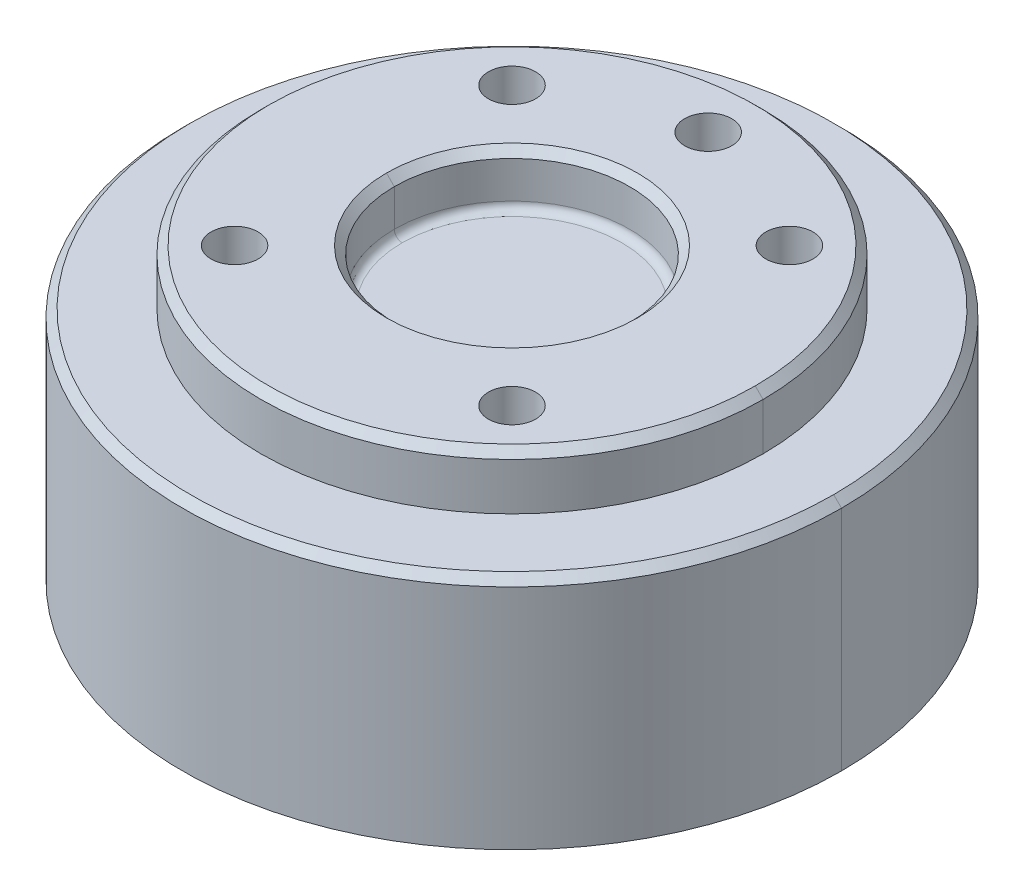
ISO-10303-21;
HEADER;
FILE_DESCRIPTION(('STEP AP214'),'2;1');
FILE_NAME('part.step','',(''),(''),'','','');
FILE_SCHEMA(('AUTOMOTIVE_DESIGN { 1 0 10303 214 1 1 1 1 }'));
ENDSEC;
DATA;
#1=APPLICATION_CONTEXT('core data for automotive mechanical design processes');
#2=APPLICATION_PROTOCOL_DEFINITION('international standard','automotive_design',2000,#1);
#3=PRODUCT_CONTEXT('',#1,'mechanical');
#4=PRODUCT('Part','Part','',(#3));
#5=PRODUCT_RELATED_PRODUCT_CATEGORY('part','',(#4));
#6=PRODUCT_DEFINITION_FORMATION('','',#4);
#7=PRODUCT_DEFINITION_CONTEXT('part definition',#1,'design');
#8=PRODUCT_DEFINITION('design','',#6,#7);
#9=PRODUCT_DEFINITION_SHAPE('','',#8);
#10=(LENGTH_UNIT() NAMED_UNIT(*) SI_UNIT(.MILLI.,.METRE.));
#11=(NAMED_UNIT(*) PLANE_ANGLE_UNIT() SI_UNIT($,.RADIAN.));
#12=(NAMED_UNIT(*) SI_UNIT($,.STERADIAN.) SOLID_ANGLE_UNIT());
#13=UNCERTAINTY_MEASURE_WITH_UNIT(LENGTH_MEASURE(1.E-05),#10,'distance_accuracy_value','');
#14=(GEOMETRIC_REPRESENTATION_CONTEXT(3) GLOBAL_UNCERTAINTY_ASSIGNED_CONTEXT((#13)) GLOBAL_UNIT_ASSIGNED_CONTEXT((#10,
#11,#12)) REPRESENTATION_CONTEXT('',''));
#15=CARTESIAN_POINT('',(0.,0.,0.));
#16=DIRECTION('',(0.,0.,1.));
#17=DIRECTION('',(1.,0.,0.));
#18=AXIS2_PLACEMENT_3D('',#15,#16,#17);
#19=CARTESIAN_POINT('',(0.,29.,0.));
#20=DIRECTION('',(0.,1.,0.));
#21=DIRECTION('',(-1.,0.,0.));
#22=AXIS2_PLACEMENT_3D('',#19,#20,#21);
#23=PLANE('',#22);
#24=CARTESIAN_POINT('',(0.,29.,-25.));
#25=DIRECTION('',(0.,1.,0.));
#26=DIRECTION('',(0.,0.,1.));
#27=AXIS2_PLACEMENT_3D('',#24,#25,#26);
#28=CIRCLE('',#27,3.);
#29=CARTESIAN_POINT('',(0.,29.,-22.));
#30=VERTEX_POINT('',#29);
#31=EDGE_CURVE('E28',#30,#30,#28,.T.);
#32=ORIENTED_EDGE('',*,*,#31,.T.);
#33=EDGE_LOOP('',(#32));
#34=FACE_BOUND('',#33,.T.);
#35=ADVANCED_FACE('F16',(#34),#23,.T.);
#36=CARTESIAN_POINT('',(0.,24.,0.));
#37=DIRECTION('',(0.,1.,0.));
#38=DIRECTION('',(0.,0.,1.));
#39=AXIS2_PLACEMENT_3D('',#36,#37,#38);
#40=PLANE('',#39);
#41=CARTESIAN_POINT('',(17.677669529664,24.,17.6776695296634));
#42=DIRECTION('',(0.,1.,0.));
#43=DIRECTION('',(0.,0.,1.));
#44=AXIS2_PLACEMENT_3D('',#41,#42,#43);
#45=CIRCLE('',#44,3.);
#46=CARTESIAN_POINT('',(17.677669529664,24.,20.6776695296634));
#47=VERTEX_POINT('',#46);
#48=EDGE_CURVE('E33',#47,#47,#45,.T.);
#49=ORIENTED_EDGE('',*,*,#48,.T.);
#50=EDGE_LOOP('',(#49));
#51=FACE_BOUND('',#50,.T.);
#52=ADVANCED_FACE('F408',(#51),#40,.T.);
#53=CARTESIAN_POINT('',(0.,24.,0.));
#54=DIRECTION('',(0.,1.,0.));
#55=DIRECTION('',(0.,0.,1.));
#56=AXIS2_PLACEMENT_3D('',#53,#54,#55);
#57=PLANE('',#56);
#58=CARTESIAN_POINT('',(-17.6776695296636,24.,17.6776695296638));
#59=DIRECTION('',(0.,1.,0.));
#60=DIRECTION('',(0.,0.,1.));
#61=AXIS2_PLACEMENT_3D('',#58,#59,#60);
#62=CIRCLE('',#61,3.);
#63=CARTESIAN_POINT('',(-17.6776695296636,24.,20.6776695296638));
#64=VERTEX_POINT('',#63);
#65=EDGE_CURVE('E316',#64,#64,#62,.T.);
#66=ORIENTED_EDGE('',*,*,#65,.T.);
#67=EDGE_LOOP('',(#66));
#68=FACE_BOUND('',#67,.T.);
#69=ADVANCED_FACE('F406',(#68),#57,.T.);
#70=CARTESIAN_POINT('',(0.,24.,0.));
#71=DIRECTION('',(0.,1.,0.));
#72=DIRECTION('',(0.,0.,1.));
#73=AXIS2_PLACEMENT_3D('',#70,#71,#72);
#74=PLANE('',#73);
#75=CARTESIAN_POINT('',(-17.6776695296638,24.,-17.6776695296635));
#76=DIRECTION('',(0.,1.,0.));
#77=DIRECTION('',(0.,0.,1.));
#78=AXIS2_PLACEMENT_3D('',#75,#76,#77);
#79=CIRCLE('',#78,3.);
#80=CARTESIAN_POINT('',(-17.6776695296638,24.,-14.6776695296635));
#81=VERTEX_POINT('',#80);
#82=EDGE_CURVE('E156',#81,#81,#79,.T.);
#83=ORIENTED_EDGE('',*,*,#82,.T.);
#84=EDGE_LOOP('',(#83));
#85=FACE_BOUND('',#84,.T.);
#86=ADVANCED_FACE('F322',(#85),#74,.T.);
#87=CARTESIAN_POINT('',(0.,24.,0.));
#88=DIRECTION('',(0.,1.,0.));
#89=DIRECTION('',(-1.,0.,0.));
#90=AXIS2_PLACEMENT_3D('',#87,#88,#89);
#91=PLANE('',#90);
#92=CARTESIAN_POINT('',(17.6776695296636,24.,-17.6776695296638));
#93=DIRECTION('',(0.,1.,0.));
#94=DIRECTION('',(0.,0.,1.));
#95=AXIS2_PLACEMENT_3D('',#92,#93,#94);
#96=CIRCLE('',#95,3.);
#97=CARTESIAN_POINT('',(17.6776695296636,24.,-14.6776695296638));
#98=VERTEX_POINT('',#97);
#99=EDGE_CURVE('E153',#98,#98,#96,.T.);
#100=ORIENTED_EDGE('',*,*,#99,.T.);
#101=EDGE_LOOP('',(#100));
#102=FACE_BOUND('',#101,.T.);
#103=ADVANCED_FACE('F399',(#102),#91,.T.);
#104=CARTESIAN_POINT('',(0.,37.,-25.));
#105=DIRECTION('',(0.,1.,0.));
#106=DIRECTION('',(0.,0.,1.));
#107=AXIS2_PLACEMENT_3D('',#104,#105,#106);
#108=CYLINDRICAL_SURFACE('',#107,3.);
#109=ORIENTED_EDGE('',*,*,#31,.F.);
#110=EDGE_LOOP('',(#109));
#111=FACE_BOUND('',#110,.T.);
#112=CARTESIAN_POINT('',(0.,37.,-25.));
#113=DIRECTION('',(0.,1.,0.));
#114=DIRECTION('',(0.,0.,1.));
#115=AXIS2_PLACEMENT_3D('',#112,#113,#114);
#116=CIRCLE('',#115,3.);
#117=CARTESIAN_POINT('',(0.,37.,-22.));
#118=VERTEX_POINT('',#117);
#119=EDGE_CURVE('E344',#118,#118,#116,.T.);
#120=ORIENTED_EDGE('',*,*,#119,.T.);
#121=EDGE_LOOP('',(#120));
#122=FACE_BOUND('',#121,.T.);
#123=ADVANCED_FACE('F402',(#111,#122),#108,.F.);
#124=CARTESIAN_POINT('',(0.,37.,0.));
#125=DIRECTION('',(0.,1.,0.));
#126=DIRECTION('',(0.,0.,1.));
#127=AXIS2_PLACEMENT_3D('',#124,#125,#126);
#128=PLANE('',#127);
#129=ORIENTED_EDGE('',*,*,#119,.F.);
#130=EDGE_LOOP('',(#129));
#131=FACE_BOUND('',#130,.T.);
#132=CARTESIAN_POINT('',(17.677669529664,37.,17.6776695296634));
#133=DIRECTION('',(0.,1.,0.));
#134=DIRECTION('',(0.,0.,1.));
#135=AXIS2_PLACEMENT_3D('',#132,#133,#134);
#136=CIRCLE('',#135,3.);
#137=CARTESIAN_POINT('',(17.677669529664,37.,20.6776695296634));
#138=VERTEX_POINT('',#137);
#139=EDGE_CURVE('E339',#138,#138,#136,.T.);
#140=ORIENTED_EDGE('',*,*,#139,.F.);
#141=EDGE_LOOP('',(#140));
#142=FACE_BOUND('',#141,.T.);
#143=CARTESIAN_POINT('',(-17.6776695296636,37.,17.6776695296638));
#144=DIRECTION('',(0.,1.,0.));
#145=DIRECTION('',(0.,0.,1.));
#146=AXIS2_PLACEMENT_3D('',#143,#144,#145);
#147=CIRCLE('',#146,3.);
#148=CARTESIAN_POINT('',(-17.6776695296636,37.,20.6776695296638));
#149=VERTEX_POINT('',#148);
#150=EDGE_CURVE('E334',#149,#149,#147,.T.);
#151=ORIENTED_EDGE('',*,*,#150,.F.);
#152=EDGE_LOOP('',(#151));
#153=FACE_BOUND('',#152,.T.);
#154=CARTESIAN_POINT('',(-17.6776695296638,37.,-17.6776695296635));
#155=DIRECTION('',(0.,1.,0.));
#156=DIRECTION('',(0.,0.,1.));
#157=AXIS2_PLACEMENT_3D('',#154,#155,#156);
#158=CIRCLE('',#157,3.);
#159=CARTESIAN_POINT('',(-17.6776695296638,37.,-14.6776695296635));
#160=VERTEX_POINT('',#159);
#161=EDGE_CURVE('E332',#160,#160,#158,.T.);
#162=ORIENTED_EDGE('',*,*,#161,.F.);
#163=EDGE_LOOP('',(#162));
#164=FACE_BOUND('',#163,.T.);
#165=CARTESIAN_POINT('',(17.6776695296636,37.,-17.6776695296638));
#166=DIRECTION('',(0.,1.,0.));
#167=DIRECTION('',(0.,0.,1.));
#168=AXIS2_PLACEMENT_3D('',#165,#166,#167);
#169=CIRCLE('',#168,3.);
#170=CARTESIAN_POINT('',(17.6776695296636,37.,-14.6776695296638));
#171=VERTEX_POINT('',#170);
#172=EDGE_CURVE('E139',#171,#171,#169,.T.);
#173=ORIENTED_EDGE('',*,*,#172,.F.);
#174=EDGE_LOOP('',(#173));
#175=FACE_BOUND('',#174,.T.);
#176=CARTESIAN_POINT('',(0.,37.0000000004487,0.));
#177=DIRECTION('',(0.,-1.,0.));
#178=DIRECTION('',(0.,0.,-1.));
#179=AXIS2_PLACEMENT_3D('',#176,#177,#178);
#180=CIRCLE('',#179,30.9999999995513);
#181=CARTESIAN_POINT('',(-30.9999999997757,37.0000000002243,9.22828831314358E-08));
#182=VERTEX_POINT('',#181);
#183=CARTESIAN_POINT('',(30.9999999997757,37.0000000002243,7.30811161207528E-08));
#184=VERTEX_POINT('',#183);
#185=EDGE_CURVE('E131',#182,#184,#180,.T.);
#186=ORIENTED_EDGE('',*,*,#185,.F.);
#187=CARTESIAN_POINT('',(0.,37.,-1.21484962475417E-13));
#188=DIRECTION('',(0.,-1.,0.));
#189=DIRECTION('',(0.,0.,-1.));
#190=AXIS2_PLACEMENT_3D('',#187,#188,#189);
#191=CIRCLE('',#190,31.);
#192=EDGE_CURVE('E135',#184,#182,#191,.T.);
#193=ORIENTED_EDGE('',*,*,#192,.F.);
#194=EDGE_LOOP('',(#186,#193));
#195=FACE_BOUND('',#194,.T.);
#196=CARTESIAN_POINT('',(0.,37.,0.));
#197=DIRECTION('',(0.,1.,0.));
#198=DIRECTION('',(0.,0.,1.));
#199=AXIS2_PLACEMENT_3D('',#196,#197,#198);
#200=CIRCLE('',#199,16.);
#201=CARTESIAN_POINT('',(-16.,37.,-3.20409330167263E-07));
#202=VERTEX_POINT('',#201);
#203=CARTESIAN_POINT('',(16.,37.,-3.5926469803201E-07));
#204=VERTEX_POINT('',#203);
#205=EDGE_CURVE('E147',#202,#204,#200,.F.);
#206=ORIENTED_EDGE('',*,*,#205,.T.);
#207=CARTESIAN_POINT('',(0.,37.,0.));
#208=DIRECTION('',(0.,1.,0.));
#209=DIRECTION('',(0.,0.,1.));
#210=AXIS2_PLACEMENT_3D('',#207,#208,#209);
#211=CIRCLE('',#210,16.);
#212=EDGE_CURVE('E314',#204,#202,#211,.F.);
#213=ORIENTED_EDGE('',*,*,#212,.T.);
#214=EDGE_LOOP('',(#206,#213));
#215=FACE_BOUND('',#214,.T.);
#216=ADVANCED_FACE('F133',(#131,#142,#153,#164,#175,#195,#215),#128,.T.);
#217=CARTESIAN_POINT('',(17.677669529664,37.,17.6776695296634));
#218=DIRECTION('',(0.,1.,0.));
#219=DIRECTION('',(0.,0.,1.));
#220=AXIS2_PLACEMENT_3D('',#217,#218,#219);
#221=CYLINDRICAL_SURFACE('',#220,3.);
#222=ORIENTED_EDGE('',*,*,#48,.F.);
#223=EDGE_LOOP('',(#222));
#224=FACE_BOUND('',#223,.T.);
#225=ORIENTED_EDGE('',*,*,#139,.T.);
#226=EDGE_LOOP('',(#225));
#227=FACE_BOUND('',#226,.T.);
#228=ADVANCED_FACE('F441',(#224,#227),#221,.F.);
#229=CARTESIAN_POINT('',(-17.6776695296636,37.,17.6776695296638));
#230=DIRECTION('',(0.,1.,0.));
#231=DIRECTION('',(0.,0.,1.));
#232=AXIS2_PLACEMENT_3D('',#229,#230,#231);
#233=CYLINDRICAL_SURFACE('',#232,3.);
#234=ORIENTED_EDGE('',*,*,#65,.F.);
#235=EDGE_LOOP('',(#234));
#236=FACE_BOUND('',#235,.T.);
#237=ORIENTED_EDGE('',*,*,#150,.T.);
#238=EDGE_LOOP('',(#237));
#239=FACE_BOUND('',#238,.T.);
#240=ADVANCED_FACE('F328',(#236,#239),#233,.F.);
#241=CARTESIAN_POINT('',(-17.6776695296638,37.,-17.6776695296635));
#242=DIRECTION('',(0.,1.,0.));
#243=DIRECTION('',(0.,0.,1.));
#244=AXIS2_PLACEMENT_3D('',#241,#242,#243);
#245=CYLINDRICAL_SURFACE('',#244,3.);
#246=ORIENTED_EDGE('',*,*,#82,.F.);
#247=EDGE_LOOP('',(#246));
#248=FACE_BOUND('',#247,.T.);
#249=ORIENTED_EDGE('',*,*,#161,.T.);
#250=EDGE_LOOP('',(#249));
#251=FACE_BOUND('',#250,.T.);
#252=ADVANCED_FACE('F324',(#248,#251),#245,.F.);
#253=CARTESIAN_POINT('',(17.6776695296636,37.,-17.6776695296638));
#254=DIRECTION('',(0.,1.,0.));
#255=DIRECTION('',(0.,0.,1.));
#256=AXIS2_PLACEMENT_3D('',#253,#254,#255);
#257=CYLINDRICAL_SURFACE('',#256,3.);
#258=ORIENTED_EDGE('',*,*,#99,.F.);
#259=EDGE_LOOP('',(#258));
#260=FACE_BOUND('',#259,.T.);
#261=ORIENTED_EDGE('',*,*,#172,.T.);
#262=EDGE_LOOP('',(#261));
#263=FACE_BOUND('',#262,.T.);
#264=ADVANCED_FACE('F327',(#260,#263),#257,.F.);
#265=CARTESIAN_POINT('',(0.,37.1097664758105,0.));
#266=DIRECTION('',(0.,-1.,0.));
#267=DIRECTION('',(0.,0.,-1.));
#268=AXIS2_PLACEMENT_3D('',#265,#266,#267);
#269=CONICAL_SURFACE('',#268,30.8902335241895,0.785398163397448);
#270=DIRECTION('',(-0.707106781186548,-0.707106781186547,2.10496593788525E-09));
#271=VECTOR('',#270,1.);
#272=CARTESIAN_POINT('',(-30.8902335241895,37.1097664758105,9.19561305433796E-08));
#273=LINE('',#272,#271);
#274=CARTESIAN_POINT('',(-31.9999999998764,36.0000000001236,7.14448153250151E-08));
#275=VERTEX_POINT('',#274);
#276=EDGE_CURVE('E144',#182,#275,#273,.T.);
#277=ORIENTED_EDGE('',*,*,#276,.F.);
#278=ORIENTED_EDGE('',*,*,#185,.T.);
#279=DIRECTION('',(0.707106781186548,-0.707106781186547,1.66697544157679E-09));
#280=VECTOR('',#279,1.);
#281=CARTESIAN_POINT('',(30.8902335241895,37.1097664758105,7.28223461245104E-08));
#282=LINE('',#281,#280);
#283=CARTESIAN_POINT('',(31.9999999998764,36.0000000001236,5.65789320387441E-08));
#284=VERTEX_POINT('',#283);
#285=EDGE_CURVE('E146',#284,#184,#282,.F.);
#286=ORIENTED_EDGE('',*,*,#285,.F.);
#287=CARTESIAN_POINT('',(0.,36.,0.));
#288=DIRECTION('',(0.,-1.,0.));
#289=DIRECTION('',(0.,0.,-1.));
#290=AXIS2_PLACEMENT_3D('',#287,#288,#289);
#291=CIRCLE('',#290,32.);
#292=EDGE_CURVE('E151',#284,#275,#291,.F.);
#293=ORIENTED_EDGE('',*,*,#292,.T.);
#294=EDGE_LOOP('',(#277,#278,#286,#293));
#295=FACE_BOUND('',#294,.T.);
#296=ADVANCED_FACE('F149',(#295),#269,.T.);
#297=CARTESIAN_POINT('',(0.,37.1097664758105,-1.21484962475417E-13));
#298=DIRECTION('',(0.,-1.,0.));
#299=DIRECTION('',(0.,0.,-1.));
#300=AXIS2_PLACEMENT_3D('',#297,#298,#299);
#301=CONICAL_SURFACE('',#300,30.8902335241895,0.785398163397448);
#302=ORIENTED_EDGE('',*,*,#285,.T.);
#303=ORIENTED_EDGE('',*,*,#192,.T.);
#304=ORIENTED_EDGE('',*,*,#276,.T.);
#305=CARTESIAN_POINT('',(0.,36.0000000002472,-1.21484962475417E-13));
#306=DIRECTION('',(0.,-1.,0.));
#307=DIRECTION('',(0.,0.,-1.));
#308=AXIS2_PLACEMENT_3D('',#305,#306,#307);
#309=CIRCLE('',#308,31.9999999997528);
#310=EDGE_CURVE('E161',#275,#284,#309,.F.);
#311=ORIENTED_EDGE('',*,*,#310,.T.);
#312=EDGE_LOOP('',(#302,#303,#304,#311));
#313=FACE_BOUND('',#312,.T.);
#314=ADVANCED_FACE('F142',(#313),#301,.T.);
#315=CARTESIAN_POINT('',(0.,30.,0.));
#316=DIRECTION('',(0.,1.,0.));
#317=DIRECTION('',(0.,0.,1.));
#318=AXIS2_PLACEMENT_3D('',#315,#316,#317);
#319=CYLINDRICAL_SURFACE('',#318,32.);
#320=DIRECTION('',(0.,1.,0.));
#321=VECTOR('',#320,1.);
#322=CARTESIAN_POINT('',(32.,30.,0.));
#323=LINE('',#322,#321);
#324=CARTESIAN_POINT('',(32.,30.,0.));
#325=VERTEX_POINT('',#324);
#326=EDGE_CURVE('E163',#284,#325,#323,.F.);
#327=ORIENTED_EDGE('',*,*,#326,.F.);
#328=ORIENTED_EDGE('',*,*,#310,.F.);
#329=DIRECTION('',(0.,1.,0.));
#330=VECTOR('',#329,1.);
#331=CARTESIAN_POINT('',(-32.,30.,0.));
#332=LINE('',#331,#330);
#333=CARTESIAN_POINT('',(-32.,30.,0.));
#334=VERTEX_POINT('',#333);
#335=EDGE_CURVE('E165',#334,#275,#332,.T.);
#336=ORIENTED_EDGE('',*,*,#335,.F.);
#337=CARTESIAN_POINT('',(0.,30.,0.));
#338=DIRECTION('',(0.,1.,0.));
#339=DIRECTION('',(0.,0.,1.));
#340=AXIS2_PLACEMENT_3D('',#337,#338,#339);
#341=CIRCLE('',#340,32.);
#342=EDGE_CURVE('E168',#325,#334,#341,.F.);
#343=ORIENTED_EDGE('',*,*,#342,.F.);
#344=EDGE_LOOP('',(#327,#328,#336,#343));
#345=FACE_BOUND('',#344,.T.);
#346=ADVANCED_FACE('F635',(#345),#319,.T.);
#347=CARTESIAN_POINT('',(0.,30.,0.));
#348=DIRECTION('',(0.,1.,0.));
#349=DIRECTION('',(0.,0.,1.));
#350=AXIS2_PLACEMENT_3D('',#347,#348,#349);
#351=CYLINDRICAL_SURFACE('',#350,32.);
#352=ORIENTED_EDGE('',*,*,#335,.T.);
#353=ORIENTED_EDGE('',*,*,#292,.F.);
#354=ORIENTED_EDGE('',*,*,#326,.T.);
#355=CARTESIAN_POINT('',(0.,30.,0.));
#356=DIRECTION('',(0.,1.,0.));
#357=DIRECTION('',(0.,0.,1.));
#358=AXIS2_PLACEMENT_3D('',#355,#356,#357);
#359=CIRCLE('',#358,32.);
#360=EDGE_CURVE('E171',#334,#325,#359,.F.);
#361=ORIENTED_EDGE('',*,*,#360,.F.);
#362=EDGE_LOOP('',(#352,#353,#354,#361));
#363=FACE_BOUND('',#362,.T.);
#364=ADVANCED_FACE('F627',(#363),#351,.T.);
#365=CARTESIAN_POINT('',(0.,30.,0.));
#366=DIRECTION('',(0.,1.,0.));
#367=DIRECTION('',(0.,0.,1.));
#368=AXIS2_PLACEMENT_3D('',#365,#366,#367);
#369=PLANE('',#368);
#370=CARTESIAN_POINT('',(0.,30.0000000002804,0.));
#371=DIRECTION('',(0.,-1.,0.));
#372=DIRECTION('',(0.,0.,-1.));
#373=AXIS2_PLACEMENT_3D('',#370,#371,#372);
#374=CIRCLE('',#373,40.9999999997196);
#375=CARTESIAN_POINT('',(-40.9999999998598,30.0000000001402,7.80053308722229E-08));
#376=VERTEX_POINT('',#375);
#377=CARTESIAN_POINT('',(40.9999999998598,30.0000000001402,6.02068889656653E-08));
#378=VERTEX_POINT('',#377);
#379=EDGE_CURVE('E174',#376,#378,#374,.T.);
#380=ORIENTED_EDGE('',*,*,#379,.F.);
#381=CARTESIAN_POINT('',(0.,30.,-2.10884178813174E-13));
#382=DIRECTION('',(0.,-1.,0.));
#383=DIRECTION('',(0.,0.,-1.));
#384=AXIS2_PLACEMENT_3D('',#381,#382,#383);
#385=CIRCLE('',#384,41.);
#386=EDGE_CURVE('E176',#378,#376,#385,.T.);
#387=ORIENTED_EDGE('',*,*,#386,.F.);
#388=EDGE_LOOP('',(#380,#387));
#389=FACE_BOUND('',#388,.T.);
#390=ORIENTED_EDGE('',*,*,#342,.T.);
#391=ORIENTED_EDGE('',*,*,#360,.T.);
#392=EDGE_LOOP('',(#390,#391));
#393=FACE_BOUND('',#392,.T.);
#394=ADVANCED_FACE('F619',(#389,#393),#369,.T.);
#395=CARTESIAN_POINT('',(0.,30.1097664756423,0.));
#396=DIRECTION('',(0.,-1.,0.));
#397=DIRECTION('',(0.,0.,-1.));
#398=AXIS2_PLACEMENT_3D('',#395,#396,#397);
#399=CONICAL_SURFACE('',#398,40.8902335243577,0.785398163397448);
#400=DIRECTION('',(-0.707106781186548,-0.707106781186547,1.34532317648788E-09));
#401=VECTOR('',#400,1.);
#402=CARTESIAN_POINT('',(-40.8902335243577,30.1097664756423,7.7796495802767E-08));
#403=LINE('',#402,#401);
#404=CARTESIAN_POINT('',(-41.9999999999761,29.0000000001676,2.99654610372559E-08));
#405=VERTEX_POINT('',#404);
#406=EDGE_CURVE('E179',#376,#405,#403,.T.);
#407=ORIENTED_EDGE('',*,*,#406,.F.);
#408=ORIENTED_EDGE('',*,*,#379,.T.);
#409=DIRECTION('',(0.707106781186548,-0.707106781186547,1.03836223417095E-09));
#410=VECTOR('',#409,1.);
#411=CARTESIAN_POINT('',(40.8902335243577,30.1097664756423,6.00457049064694E-08));
#412=LINE('',#411,#410);
#413=CARTESIAN_POINT('',(41.9999999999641,29.0000000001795,1.54188417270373E-08));
#414=VERTEX_POINT('',#413);
#415=EDGE_CURVE('E181',#414,#378,#412,.F.);
#416=ORIENTED_EDGE('',*,*,#415,.F.);
#417=CARTESIAN_POINT('',(0.,29.,0.));
#418=DIRECTION('',(0.,1.,0.));
#419=DIRECTION('',(0.,0.,1.));
#420=AXIS2_PLACEMENT_3D('',#417,#418,#419);
#421=CIRCLE('',#420,42.);
#422=EDGE_CURVE('E184',#405,#414,#421,.F.);
#423=ORIENTED_EDGE('',*,*,#422,.F.);
#424=EDGE_LOOP('',(#407,#408,#416,#423));
#425=FACE_BOUND('',#424,.T.);
#426=ADVANCED_FACE('F611',(#425),#399,.T.);
#427=CARTESIAN_POINT('',(0.,30.1097664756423,-2.10884178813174E-13));
#428=DIRECTION('',(0.,-1.,0.));
#429=DIRECTION('',(0.,0.,-1.));
#430=AXIS2_PLACEMENT_3D('',#427,#428,#429);
#431=CONICAL_SURFACE('',#430,40.8902335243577,0.785398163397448);
#432=ORIENTED_EDGE('',*,*,#415,.T.);
#433=ORIENTED_EDGE('',*,*,#386,.T.);
#434=ORIENTED_EDGE('',*,*,#406,.T.);
#435=CARTESIAN_POINT('',(0.,29.0000000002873,0.));
#436=DIRECTION('',(0.,1.,0.));
#437=DIRECTION('',(0.,0.,1.));
#438=AXIS2_PLACEMENT_3D('',#435,#436,#437);
#439=CIRCLE('',#438,42.);
#440=EDGE_CURVE('E187',#414,#405,#439,.F.);
#441=ORIENTED_EDGE('',*,*,#440,.F.);
#442=EDGE_LOOP('',(#432,#433,#434,#441));
#443=FACE_BOUND('',#442,.T.);
#444=ADVANCED_FACE('F603',(#443),#431,.T.);
#445=CARTESIAN_POINT('',(0.,0.,0.));
#446=DIRECTION('',(0.,1.,0.));
#447=DIRECTION('',(0.,0.,1.));
#448=AXIS2_PLACEMENT_3D('',#445,#446,#447);
#449=CYLINDRICAL_SURFACE('',#448,42.);
#450=DIRECTION('',(0.,1.,0.));
#451=VECTOR('',#450,1.);
#452=CARTESIAN_POINT('',(42.,0.,0.));
#453=LINE('',#452,#451);
#454=CARTESIAN_POINT('',(42.,0.,0.));
#455=VERTEX_POINT('',#454);
#456=EDGE_CURVE('E190',#455,#414,#453,.T.);
#457=ORIENTED_EDGE('',*,*,#456,.T.);
#458=ORIENTED_EDGE('',*,*,#440,.T.);
#459=DIRECTION('',(0.,1.,0.));
#460=VECTOR('',#459,1.);
#461=CARTESIAN_POINT('',(-42.,0.,0.));
#462=LINE('',#461,#460);
#463=CARTESIAN_POINT('',(-42.,0.,0.));
#464=VERTEX_POINT('',#463);
#465=EDGE_CURVE('E193',#405,#464,#462,.F.);
#466=ORIENTED_EDGE('',*,*,#465,.T.);
#467=CARTESIAN_POINT('',(0.,0.,0.));
#468=DIRECTION('',(0.,1.,0.));
#469=DIRECTION('',(0.,0.,1.));
#470=AXIS2_PLACEMENT_3D('',#467,#468,#469);
#471=CIRCLE('',#470,42.);
#472=EDGE_CURVE('E195',#464,#455,#471,.T.);
#473=ORIENTED_EDGE('',*,*,#472,.T.);
#474=EDGE_LOOP('',(#457,#458,#466,#473));
#475=FACE_BOUND('',#474,.T.);
#476=ADVANCED_FACE('F595',(#475),#449,.T.);
#477=CARTESIAN_POINT('',(0.,0.,0.));
#478=DIRECTION('',(0.,1.,0.));
#479=DIRECTION('',(0.,0.,1.));
#480=AXIS2_PLACEMENT_3D('',#477,#478,#479);
#481=CYLINDRICAL_SURFACE('',#480,42.);
#482=ORIENTED_EDGE('',*,*,#465,.F.);
#483=ORIENTED_EDGE('',*,*,#422,.T.);
#484=ORIENTED_EDGE('',*,*,#456,.F.);
#485=CARTESIAN_POINT('',(0.,0.,0.));
#486=DIRECTION('',(0.,1.,0.));
#487=DIRECTION('',(0.,0.,1.));
#488=AXIS2_PLACEMENT_3D('',#485,#486,#487);
#489=CIRCLE('',#488,42.);
#490=EDGE_CURVE('E198',#455,#464,#489,.T.);
#491=ORIENTED_EDGE('',*,*,#490,.T.);
#492=EDGE_LOOP('',(#482,#483,#484,#491));
#493=FACE_BOUND('',#492,.T.);
#494=DIRECTION('',(0.,1.,0.));
#495=VECTOR('',#494,1.);
#496=CARTESIAN_POINT('',(15.5884572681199,0.,-39.));
#497=LINE('',#496,#495);
#498=CARTESIAN_POINT('',(15.5884572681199,10.,-39.));
#499=VERTEX_POINT('',#498);
#500=CARTESIAN_POINT('',(15.5884572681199,25.,-39.));
#501=VERTEX_POINT('',#500);
#502=EDGE_CURVE('E201',#499,#501,#497,.T.);
#503=ORIENTED_EDGE('',*,*,#502,.T.);
#504=CARTESIAN_POINT('',(0.,25.,0.));
#505=DIRECTION('',(0.,1.,0.));
#506=DIRECTION('',(0.,0.,1.));
#507=AXIS2_PLACEMENT_3D('',#504,#505,#506);
#508=CIRCLE('',#507,42.);
#509=CARTESIAN_POINT('',(-15.5884572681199,25.,-39.));
#510=VERTEX_POINT('',#509);
#511=EDGE_CURVE('E203',#501,#510,#508,.T.);
#512=ORIENTED_EDGE('',*,*,#511,.T.);
#513=DIRECTION('',(0.,1.,0.));
#514=VECTOR('',#513,1.);
#515=CARTESIAN_POINT('',(-15.5884572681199,0.,-39.));
#516=LINE('',#515,#514);
#517=CARTESIAN_POINT('',(-15.5884572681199,10.,-39.));
#518=VERTEX_POINT('',#517);
#519=EDGE_CURVE('E205',#510,#518,#516,.F.);
#520=ORIENTED_EDGE('',*,*,#519,.T.);
#521=CARTESIAN_POINT('',(0.,10.,0.));
#522=DIRECTION('',(0.,1.,0.));
#523=DIRECTION('',(0.,0.,1.));
#524=AXIS2_PLACEMENT_3D('',#521,#522,#523);
#525=CIRCLE('',#524,42.);
#526=EDGE_CURVE('E207',#518,#499,#525,.F.);
#527=ORIENTED_EDGE('',*,*,#526,.T.);
#528=EDGE_LOOP('',(#503,#512,#520,#527));
#529=FACE_BOUND('',#528,.T.);
#530=ADVANCED_FACE('F588',(#493,#529),#481,.T.);
#531=CARTESIAN_POINT('',(0.,0.,0.));
#532=DIRECTION('',(0.,1.,0.));
#533=DIRECTION('',(0.,0.,1.));
#534=AXIS2_PLACEMENT_3D('',#531,#532,#533);
#535=PLANE('',#534);
#536=CARTESIAN_POINT('',(0.,0.,0.));
#537=DIRECTION('',(0.,1.,0.));
#538=DIRECTION('',(0.,0.,1.));
#539=AXIS2_PLACEMENT_3D('',#536,#537,#538);
#540=CIRCLE('',#539,40.5459553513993);
#541=CARTESIAN_POINT('',(0.,0.,40.5459553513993));
#542=VERTEX_POINT('',#541);
#543=EDGE_CURVE('E210',#542,#542,#540,.T.);
#544=ORIENTED_EDGE('',*,*,#543,.T.);
#545=EDGE_LOOP('',(#544));
#546=FACE_BOUND('',#545,.T.);
#547=ORIENTED_EDGE('',*,*,#490,.F.);
#548=ORIENTED_EDGE('',*,*,#472,.F.);
#549=EDGE_LOOP('',(#547,#548));
#550=FACE_BOUND('',#549,.T.);
#551=ADVANCED_FACE('F489',(#546,#550),#535,.F.);
#552=CARTESIAN_POINT('',(0.,1.50000000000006,0.));
#553=DIRECTION('',(0.,-1.,0.));
#554=DIRECTION('',(0.,0.,-1.));
#555=AXIS2_PLACEMENT_3D('',#552,#553,#554);
#556=CONICAL_SURFACE('',#555,40.,0.349065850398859);
#557=ORIENTED_EDGE('',*,*,#543,.F.);
#558=EDGE_LOOP('',(#557));
#559=FACE_BOUND('',#558,.T.);
#560=CARTESIAN_POINT('',(0.,1.50000000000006,0.));
#561=DIRECTION('',(0.,1.,0.));
#562=DIRECTION('',(0.,0.,1.));
#563=AXIS2_PLACEMENT_3D('',#560,#561,#562);
#564=CIRCLE('',#563,40.);
#565=CARTESIAN_POINT('',(0.,1.50000000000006,40.));
#566=VERTEX_POINT('',#565);
#567=EDGE_CURVE('E213',#566,#566,#564,.F.);
#568=ORIENTED_EDGE('',*,*,#567,.F.);
#569=EDGE_LOOP('',(#568));
#570=FACE_BOUND('',#569,.T.);
#571=ADVANCED_FACE('F482',(#559,#570),#556,.F.);
#572=CARTESIAN_POINT('',(0.,5.3,0.));
#573=DIRECTION('',(0.,-1.,0.));
#574=DIRECTION('',(0.,0.,-1.));
#575=AXIS2_PLACEMENT_3D('',#572,#573,#574);
#576=CYLINDRICAL_SURFACE('',#575,40.);
#577=ORIENTED_EDGE('',*,*,#567,.T.);
#578=EDGE_LOOP('',(#577));
#579=FACE_BOUND('',#578,.T.);
#580=CARTESIAN_POINT('',(0.,5.3,0.));
#581=DIRECTION('',(0.,-1.,0.));
#582=DIRECTION('',(0.,0.,-1.));
#583=AXIS2_PLACEMENT_3D('',#580,#581,#582);
#584=CIRCLE('',#583,40.);
#585=CARTESIAN_POINT('',(0.,5.3,-40.));
#586=VERTEX_POINT('',#585);
#587=EDGE_CURVE('E216',#586,#586,#584,.T.);
#588=ORIENTED_EDGE('',*,*,#587,.F.);
#589=EDGE_LOOP('',(#588));
#590=FACE_BOUND('',#589,.T.);
#591=ADVANCED_FACE('F488',(#579,#590),#576,.F.);
#592=CARTESIAN_POINT('',(0.,5.3,0.));
#593=DIRECTION('',(0.,-1.,0.));
#594=DIRECTION('',(0.,0.,-1.));
#595=AXIS2_PLACEMENT_3D('',#592,#593,#594);
#596=PLANE('',#595);
#597=ORIENTED_EDGE('',*,*,#587,.T.);
#598=EDGE_LOOP('',(#597));
#599=FACE_BOUND('',#598,.T.);
#600=ADVANCED_FACE('F500',(#599),#596,.T.);
#601=CARTESIAN_POINT('',(-48.15,25.,-39.));
#602=DIRECTION('',(0.,0.,1.));
#603=DIRECTION('',(1.,0.,0.));
#604=AXIS2_PLACEMENT_3D('',#601,#602,#603);
#605=PLANE('',#604);
#606=CARTESIAN_POINT('',(0.,17.5,-39.));
#607=DIRECTION('',(0.,0.,-1.));
#608=DIRECTION('',(-1.,0.,0.));
#609=AXIS2_PLACEMENT_3D('',#606,#607,#608);
#610=CIRCLE('',#609,6.);
#611=CARTESIAN_POINT('',(0.,11.5,-39.));
#612=VERTEX_POINT('',#611);
#613=CARTESIAN_POINT('',(0.,23.5,-39.));
#614=VERTEX_POINT('',#613);
#615=EDGE_CURVE('E219',#612,#614,#610,.T.);
#616=ORIENTED_EDGE('',*,*,#615,.F.);
#617=CARTESIAN_POINT('',(0.,17.5,-39.));
#618=DIRECTION('',(0.,0.,-1.));
#619=DIRECTION('',(-1.,0.,0.));
#620=AXIS2_PLACEMENT_3D('',#617,#618,#619);
#621=CIRCLE('',#620,6.);
#622=EDGE_CURVE('E221',#614,#612,#621,.T.);
#623=ORIENTED_EDGE('',*,*,#622,.F.);
#624=EDGE_LOOP('',(#616,#623));
#625=FACE_BOUND('',#624,.T.);
#626=ORIENTED_EDGE('',*,*,#519,.F.);
#627=DIRECTION('',(1.,0.,0.));
#628=VECTOR('',#627,1.);
#629=CARTESIAN_POINT('',(-48.15,25.,-39.));
#630=LINE('',#629,#628);
#631=EDGE_CURVE('E224',#510,#501,#630,.T.);
#632=ORIENTED_EDGE('',*,*,#631,.T.);
#633=ORIENTED_EDGE('',*,*,#502,.F.);
#634=DIRECTION('',(1.,0.,0.));
#635=VECTOR('',#634,1.);
#636=CARTESIAN_POINT('',(-48.15,10.,-39.));
#637=LINE('',#636,#635);
#638=EDGE_CURVE('E227',#518,#499,#637,.T.);
#639=ORIENTED_EDGE('',*,*,#638,.F.);
#640=EDGE_LOOP('',(#626,#632,#633,#639));
#641=FACE_BOUND('',#640,.T.);
#642=ADVANCED_FACE('F509',(#625,#641),#605,.F.);
#643=CARTESIAN_POINT('',(0.,17.5,-39.));
#644=DIRECTION('',(0.,0.,-1.));
#645=DIRECTION('',(-1.,0.,0.));
#646=AXIS2_PLACEMENT_3D('',#643,#644,#645);
#647=CYLINDRICAL_SURFACE('',#646,6.);
#648=DIRECTION('',(0.,0.,-1.));
#649=VECTOR('',#648,1.);
#650=CARTESIAN_POINT('',(0.,23.5,-39.));
#651=LINE('',#650,#649);
#652=CARTESIAN_POINT('',(4.65060762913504E-10,23.4999855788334,-44.));
#653=VERTEX_POINT('',#652);
#654=EDGE_CURVE('E230',#653,#614,#651,.F.);
#655=ORIENTED_EDGE('',*,*,#654,.F.);
#656=CARTESIAN_POINT('',(0.37674311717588,11.5118396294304,-44.));
#657=CARTESIAN_POINT('',(-0.0890867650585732,11.4825320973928,-44.));
#658=CARTESIAN_POINT('',(-1.02759052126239,11.5331262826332,-44.));
#659=CARTESIAN_POINT('',(-2.37965423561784,11.9325243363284,-44.));
#660=CARTESIAN_POINT('',(-3.60269367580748,12.6337765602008,-44.));
#661=CARTESIAN_POINT('',(-4.63040612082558,13.5988624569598,-44.));
#662=CARTESIAN_POINT('',(-5.40706977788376,14.7754577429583,-44.));
#663=CARTESIAN_POINT('',(-5.89057651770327,16.0997704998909,-44.));
#664=CARTESIAN_POINT('',(-6.05471174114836,17.5,-44.));
#665=CARTESIAN_POINT('',(-5.89057651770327,18.9002295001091,-44.));
#666=CARTESIAN_POINT('',(-5.40706977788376,20.2245422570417,-44.));
#667=CARTESIAN_POINT('',(-4.63040612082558,21.4011375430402,-44.));
#668=CARTESIAN_POINT('',(-3.60269367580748,22.3662234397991,-44.));
#669=CARTESIAN_POINT('',(-2.37965423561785,23.0674756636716,-44.));
#670=CARTESIAN_POINT('',(-1.0275905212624,23.4668737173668,-44.));
#671=CARTESIAN_POINT('',(-0.0890867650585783,23.5174679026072,-44.));
#672=CARTESIAN_POINT('',(0.376743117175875,23.4881603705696,-44.));
#673=B_SPLINE_CURVE_WITH_KNOTS('',3,(#656,#657,#658,#659,#660,#661,#662,#663,#664,#665,#666,
#667,#668,#669,#670,#671,#672),.UNSPECIFIED.,.F.,.F.,(4,1,1,1,1,1,1,1,1,1,1,1,1,1,4),
(-0.0628318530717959,0.170543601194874,0.403919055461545,0.637294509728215,0.870669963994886,
1.10404541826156,1.33742087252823,1.5707963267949,1.80417178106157,2.03754723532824,
2.27092268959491,2.50429814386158,2.73767359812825,2.97104905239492,3.20442450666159),.UNSPECIFIED.);
#674=CARTESIAN_POINT('',(4.65061925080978E-10,11.5000144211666,-44.));
#675=VERTEX_POINT('',#674);
#676=EDGE_CURVE('E233',#653,#675,#673,.F.);
#677=ORIENTED_EDGE('',*,*,#676,.T.);
#678=DIRECTION('',(0.,0.,-1.));
#679=VECTOR('',#678,1.);
#680=CARTESIAN_POINT('',(0.,11.5,-39.));
#681=LINE('',#680,#679);
#682=EDGE_CURVE('E236',#612,#675,#681,.T.);
#683=ORIENTED_EDGE('',*,*,#682,.F.);
#684=ORIENTED_EDGE('',*,*,#615,.T.);
#685=EDGE_LOOP('',(#655,#677,#683,#684));
#686=FACE_BOUND('',#685,.T.);
#687=ADVANCED_FACE('F570',(#686),#647,.T.);
#688=CARTESIAN_POINT('',(0.,17.5,-39.));
#689=DIRECTION('',(0.,0.,-1.));
#690=DIRECTION('',(-1.,0.,0.));
#691=AXIS2_PLACEMENT_3D('',#688,#689,#690);
#692=CYLINDRICAL_SURFACE('',#691,6.);
#693=ORIENTED_EDGE('',*,*,#682,.T.);
#694=CARTESIAN_POINT('',(-0.376743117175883,23.4881603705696,-44.));
#695=CARTESIAN_POINT('',(0.0890867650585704,23.5174679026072,-44.));
#696=CARTESIAN_POINT('',(1.02759052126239,23.4668737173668,-44.));
#697=CARTESIAN_POINT('',(2.37965423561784,23.0674756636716,-44.));
#698=CARTESIAN_POINT('',(3.60269367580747,22.3662234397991,-44.));
#699=CARTESIAN_POINT('',(4.63040612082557,21.4011375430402,-44.));
#700=CARTESIAN_POINT('',(5.40706977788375,20.2245422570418,-44.));
#701=CARTESIAN_POINT('',(5.89057651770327,18.9002295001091,-44.));
#702=CARTESIAN_POINT('',(6.05471174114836,17.5,-44.));
#703=CARTESIAN_POINT('',(5.89057651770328,16.0997704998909,-44.));
#704=CARTESIAN_POINT('',(5.40706977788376,14.7754577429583,-44.));
#705=CARTESIAN_POINT('',(4.63040612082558,13.5988624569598,-44.));
#706=CARTESIAN_POINT('',(3.60269367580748,12.6337765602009,-44.));
#707=CARTESIAN_POINT('',(2.37965423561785,11.9325243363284,-44.));
#708=CARTESIAN_POINT('',(1.0275905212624,11.5331262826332,-44.));
#709=CARTESIAN_POINT('',(0.0890867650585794,11.4825320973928,-44.));
#710=CARTESIAN_POINT('',(-0.376743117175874,11.5118396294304,-44.));
#711=B_SPLINE_CURVE_WITH_KNOTS('',3,(#694,#695,#696,#697,#698,#699,#700,#701,#702,#703,#704,
#705,#706,#707,#708,#709,#710),.UNSPECIFIED.,.F.,.F.,(4,1,1,1,1,1,1,1,1,1,1,1,1,1,4),
(-3.20442450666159,-2.97104905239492,-2.73767359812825,-2.50429814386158,-2.27092268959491,
-2.03754723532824,-1.80417178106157,-1.5707963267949,-1.33742087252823,-1.10404541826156,
-0.870669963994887,-0.637294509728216,-0.403919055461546,-0.170543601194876,0.0628318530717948),.UNSPECIFIED.);
#712=EDGE_CURVE('E239',#675,#653,#711,.F.);
#713=ORIENTED_EDGE('',*,*,#712,.T.);
#714=ORIENTED_EDGE('',*,*,#654,.T.);
#715=ORIENTED_EDGE('',*,*,#622,.T.);
#716=EDGE_LOOP('',(#693,#713,#714,#715));
#717=FACE_BOUND('',#716,.T.);
#718=ADVANCED_FACE('F564',(#717),#692,.T.);
#719=CARTESIAN_POINT('',(-0.376703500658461,23.4875306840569,-43.9117214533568));
#720=CARTESIAN_POINT('',(-0.379232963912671,23.5277353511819,-46.7367373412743));
#721=CARTESIAN_POINT('',(-0.260708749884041,21.6438469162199,-49.));
#722=CARTESIAN_POINT('',(0.,17.5,-49.));
#723=CARTESIAN_POINT('',(0.0890773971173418,23.5168351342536,-43.9117214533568));
#724=CARTESIAN_POINT('',(0.0896755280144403,23.5572365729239,-46.7367373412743));
#725=CARTESIAN_POINT('',(0.0616486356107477,21.6641279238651,-49.));
#726=CARTESIAN_POINT('',(0.,17.5,-49.));
#727=CARTESIAN_POINT('',(1.02748246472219,23.4662462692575,-43.9117214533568));
#728=CARTESIAN_POINT('',(1.03438173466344,23.5063080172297,-46.7367373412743));
#729=CARTESIAN_POINT('',(0.711099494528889,21.629116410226,-49.));
#730=CARTESIAN_POINT('',(0.,17.5,-49.));
#731=CARTESIAN_POINT('',(2.37940400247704,23.0668902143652,-43.9117214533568));
#732=CARTESIAN_POINT('',(2.39538106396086,23.1042703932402,-46.7367373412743));
#733=CARTESIAN_POINT('',(1.64673660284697,21.3527302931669,-49.));
#734=CARTESIAN_POINT('',(0.,17.5,-49.));
#735=CARTESIAN_POINT('',(3.60231483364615,22.3657117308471,-43.9117214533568));
#736=CARTESIAN_POINT('',(3.62650341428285,22.3983836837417,-46.7367373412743));
#737=CARTESIAN_POINT('',(2.4930880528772,20.8674590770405,-49.));
#738=CARTESIAN_POINT('',(0.,17.5,-49.));
#739=CARTESIAN_POINT('',(4.62991920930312,21.4007273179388,-43.9117214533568));
#740=CARTESIAN_POINT('',(4.66100787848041,21.4269196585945,-46.7367373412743));
#741=CARTESIAN_POINT('',(3.20427191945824,20.1996131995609,-49.));
#742=CARTESIAN_POINT('',(0.,17.5,-49.));
#743=CARTESIAN_POINT('',(5.40650119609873,20.2242557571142,-43.9117214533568));
#744=CARTESIAN_POINT('',(5.44280440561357,20.2425484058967,-46.7367373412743));
#745=CARTESIAN_POINT('',(3.74172835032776,19.3854014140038,-49.));
#746=CARTESIAN_POINT('',(0.,17.5,-49.));
#747=CARTESIAN_POINT('',(5.88995709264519,18.9000822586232,-43.9117214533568));
#748=CARTESIAN_POINT('',(5.92950657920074,18.9094834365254,-46.7367373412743));
#749=CARTESIAN_POINT('',(4.07631823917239,18.4689681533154,-49.));
#750=CARTESIAN_POINT('',(0.,17.5,-49.));
#751=CARTESIAN_POINT('',(6.0540750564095,17.5,-43.9117214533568));
#752=CARTESIAN_POINT('',(6.09472655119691,17.5,-46.7367373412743));
#753=CARTESIAN_POINT('',(4.18990090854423,17.5,-49.));
#754=CARTESIAN_POINT('',(0.,17.5,-49.));
#755=CARTESIAN_POINT('',(5.88995709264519,16.0999177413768,-43.9117214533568));
#756=CARTESIAN_POINT('',(5.92950657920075,16.0905165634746,-46.7367373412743));
#757=CARTESIAN_POINT('',(4.07631823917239,16.5310318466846,-49.));
#758=CARTESIAN_POINT('',(0.,17.5,-49.));
#759=CARTESIAN_POINT('',(5.40650119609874,14.7757442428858,-43.9117214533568));
#760=CARTESIAN_POINT('',(5.44280440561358,14.7574515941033,-46.7367373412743));
#761=CARTESIAN_POINT('',(3.74172835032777,15.6145985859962,-49.));
#762=CARTESIAN_POINT('',(0.,17.5,-49.));
#763=CARTESIAN_POINT('',(4.62991920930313,13.5992726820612,-43.9117214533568));
#764=CARTESIAN_POINT('',(4.66100787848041,13.5730803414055,-46.7367373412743));
#765=CARTESIAN_POINT('',(3.20427191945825,14.8003868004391,-49.));
#766=CARTESIAN_POINT('',(0.,17.5,-49.));
#767=CARTESIAN_POINT('',(3.60231483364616,12.6342882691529,-43.9117214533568));
#768=CARTESIAN_POINT('',(3.62650341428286,12.6016163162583,-46.7367373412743));
#769=CARTESIAN_POINT('',(2.49308805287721,14.1325409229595,-49.));
#770=CARTESIAN_POINT('',(0.,17.5,-49.));
#771=CARTESIAN_POINT('',(2.37940400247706,11.9331097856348,-43.9117214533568));
#772=CARTESIAN_POINT('',(2.39538106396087,11.8957296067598,-46.7367373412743));
#773=CARTESIAN_POINT('',(1.64673660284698,13.6472697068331,-49.));
#774=CARTESIAN_POINT('',(0.,17.5,-49.));
#775=CARTESIAN_POINT('',(1.02748246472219,11.5337537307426,-43.9117214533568));
#776=CARTESIAN_POINT('',(1.03438173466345,11.4936919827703,-46.7367373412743));
#777=CARTESIAN_POINT('',(0.711099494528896,13.370883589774,-49.));
#778=CARTESIAN_POINT('',(0.,17.5,-49.));
#779=CARTESIAN_POINT('',(0.0890773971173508,11.4831648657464,-43.9117214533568));
#780=CARTESIAN_POINT('',(0.0896755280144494,11.4427634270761,-46.7367373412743));
#781=CARTESIAN_POINT('',(0.0616486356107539,13.3358720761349,-49.));
#782=CARTESIAN_POINT('',(0.,17.5,-49.));
#783=CARTESIAN_POINT('',(-0.376703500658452,11.5124693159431,-43.9117214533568));
#784=CARTESIAN_POINT('',(-0.379232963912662,11.4722646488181,-46.7367373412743));
#785=CARTESIAN_POINT('',(-0.260708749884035,13.3561530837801,-49.));
#786=CARTESIAN_POINT('',(0.,17.5,-49.));
#787=B_SPLINE_SURFACE_WITH_KNOTS('',3,3,((#719,#720,#721,#722),(#723,#724,#725,#726),(#727,#728,
#729,#730),(#731,#732,#733,#734),(#735,#736,#737,#738),(#739,#740,#741,#742),(#743,#744,#745,
#746),(#747,#748,#749,#750),(#751,#752,#753,#754),(#755,#756,#757,#758),(#759,#760,#761,#762),
(#763,#764,#765,#766),(#767,#768,#769,#770),(#771,#772,#773,#774),(#775,#776,#777,#778),(#779,
#780,#781,#782),(#783,#784,#785,#786)),.UNSPECIFIED.,.F.,.F.,.F.,(4,1,1,1,1,1,1,1,1,1,1,1,1,1,
4),(4,4),(-3.20442450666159,-2.97104905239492,-2.73767359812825,-2.50429814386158,
-2.27092268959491,-2.03754723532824,-1.80417178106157,-1.5707963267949,-1.33742087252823,
-1.10404541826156,-0.870669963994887,-0.637294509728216,-0.403919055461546,-0.170543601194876,
0.0628318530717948),(-0.0105482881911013,1.),.UNSPECIFIED.);
#788=CARTESIAN_POINT('',(-3.06232927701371E-07,23.4993402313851,-43.9117214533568));
#789=CARTESIAN_POINT('',(-3.08289199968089E-07,23.5396241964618,-46.7367373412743));
#790=CARTESIAN_POINT('',(-2.11937514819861E-07,21.6520200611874,-49.));
#791=CARTESIAN_POINT('',(0.,17.5,-49.));
#792=B_SPLINE_CURVE_WITH_KNOTS('',3,(#788,#789,#790,#791),.UNSPECIFIED.,.F.,.F.,(4,4),
(-0.0105482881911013,1.),.UNSPECIFIED.);
#793=CARTESIAN_POINT('',(0.,17.5,-49.));
#794=VERTEX_POINT('',#793);
#795=EDGE_CURVE('E242',#794,#653,#792,.F.);
#796=CARTESIAN_POINT('',(-3.06232928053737E-07,11.5006597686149,-43.9117214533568));
#797=CARTESIAN_POINT('',(-3.08289200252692E-07,11.4603758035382,-46.7367373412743));
#798=CARTESIAN_POINT('',(-2.11937515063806E-07,13.3479799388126,-49.));
#799=CARTESIAN_POINT('',(0.,17.5,-49.));
#800=B_SPLINE_CURVE_WITH_KNOTS('',3,(#796,#797,#798,#799),.UNSPECIFIED.,.F.,.F.,(4,4),
(-0.0105482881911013,1.),.UNSPECIFIED.);
#801=EDGE_CURVE('E245',#675,#794,#800,.T.);
#802=ORIENTED_EDGE('',*,*,#795,.T.);
#803=ORIENTED_EDGE('',*,*,#712,.F.);
#804=ORIENTED_EDGE('',*,*,#801,.T.);
#805=EDGE_LOOP('',(#802,#803,#804));
#806=FACE_BOUND('',#805,.T.);
#807=ADVANCED_FACE('F367',(#806),#787,.T.);
#808=CARTESIAN_POINT('',(0.376703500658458,11.5124693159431,-43.9117214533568));
#809=CARTESIAN_POINT('',(0.379232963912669,11.4722646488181,-46.7367373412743));
#810=CARTESIAN_POINT('',(0.26070874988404,13.3561530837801,-49.));
#811=CARTESIAN_POINT('',(0.,17.5,-49.));
#812=CARTESIAN_POINT('',(-0.0890773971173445,11.4831648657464,-43.9117214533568));
#813=CARTESIAN_POINT('',(-0.0896755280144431,11.4427634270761,-46.7367373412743));
#814=CARTESIAN_POINT('',(-0.0616486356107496,13.3358720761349,-49.));
#815=CARTESIAN_POINT('',(0.,17.5,-49.));
#816=CARTESIAN_POINT('',(-1.02748246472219,11.5337537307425,-43.9117214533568));
#817=CARTESIAN_POINT('',(-1.03438173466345,11.4936919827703,-46.7367373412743));
#818=CARTESIAN_POINT('',(-0.711099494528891,13.370883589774,-49.));
#819=CARTESIAN_POINT('',(0.,17.5,-49.));
#820=CARTESIAN_POINT('',(-2.37940400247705,11.9331097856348,-43.9117214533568));
#821=CARTESIAN_POINT('',(-2.39538106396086,11.8957296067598,-46.7367373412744));
#822=CARTESIAN_POINT('',(-1.64673660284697,13.6472697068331,-49.));
#823=CARTESIAN_POINT('',(0.,17.5,-49.));
#824=CARTESIAN_POINT('',(-3.60231483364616,12.6342882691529,-43.9117214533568));
#825=CARTESIAN_POINT('',(-3.62650341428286,12.6016163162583,-46.7367373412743));
#826=CARTESIAN_POINT('',(-2.4930880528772,14.1325409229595,-49.));
#827=CARTESIAN_POINT('',(0.,17.5,-49.));
#828=CARTESIAN_POINT('',(-4.62991920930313,13.5992726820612,-43.9117214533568));
#829=CARTESIAN_POINT('',(-4.66100787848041,13.5730803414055,-46.7367373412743));
#830=CARTESIAN_POINT('',(-3.20427191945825,14.8003868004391,-49.));
#831=CARTESIAN_POINT('',(0.,17.5,-49.));
#832=CARTESIAN_POINT('',(-5.40650119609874,14.7757442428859,-43.9117214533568));
#833=CARTESIAN_POINT('',(-5.44280440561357,14.7574515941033,-46.7367373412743));
#834=CARTESIAN_POINT('',(-3.74172835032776,15.6145985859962,-49.));
#835=CARTESIAN_POINT('',(0.,17.5,-49.));
#836=CARTESIAN_POINT('',(-5.88995709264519,16.0999177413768,-43.9117214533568));
#837=CARTESIAN_POINT('',(-5.92950657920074,16.0905165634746,-46.7367373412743));
#838=CARTESIAN_POINT('',(-4.07631823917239,16.5310318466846,-49.));
#839=CARTESIAN_POINT('',(0.,17.5,-49.));
#840=CARTESIAN_POINT('',(-6.0540750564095,17.5,-43.9117214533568));
#841=CARTESIAN_POINT('',(-6.09472655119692,17.5,-46.7367373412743));
#842=CARTESIAN_POINT('',(-4.18990090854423,17.5,-49.));
#843=CARTESIAN_POINT('',(0.,17.5,-49.));
#844=CARTESIAN_POINT('',(-5.88995709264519,18.9000822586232,-43.9117214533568));
#845=CARTESIAN_POINT('',(-5.92950657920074,18.9094834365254,-46.7367373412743));
#846=CARTESIAN_POINT('',(-4.07631823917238,18.4689681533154,-49.));
#847=CARTESIAN_POINT('',(0.,17.5,-49.));
#848=CARTESIAN_POINT('',(-5.40650119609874,20.2242557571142,-43.9117214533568));
#849=CARTESIAN_POINT('',(-5.44280440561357,20.2425484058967,-46.7367373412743));
#850=CARTESIAN_POINT('',(-3.74172835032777,19.3854014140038,-49.));
#851=CARTESIAN_POINT('',(0.,17.5,-49.));
#852=CARTESIAN_POINT('',(-4.62991920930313,21.4007273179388,-43.9117214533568));
#853=CARTESIAN_POINT('',(-4.66100787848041,21.4269196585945,-46.7367373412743));
#854=CARTESIAN_POINT('',(-3.20427191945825,20.1996131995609,-49.));
#855=CARTESIAN_POINT('',(0.,17.5,-49.));
#856=CARTESIAN_POINT('',(-3.60231483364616,22.3657117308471,-43.9117214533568));
#857=CARTESIAN_POINT('',(-3.62650341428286,22.3983836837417,-46.7367373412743));
#858=CARTESIAN_POINT('',(-2.49308805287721,20.8674590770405,-49.));
#859=CARTESIAN_POINT('',(0.,17.5,-49.));
#860=CARTESIAN_POINT('',(-2.37940400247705,23.0668902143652,-43.9117214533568));
#861=CARTESIAN_POINT('',(-2.39538106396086,23.1042703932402,-46.7367373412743));
#862=CARTESIAN_POINT('',(-1.64673660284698,21.3527302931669,-49.));
#863=CARTESIAN_POINT('',(0.,17.5,-49.));
#864=CARTESIAN_POINT('',(-1.02748246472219,23.4662462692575,-43.9117214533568));
#865=CARTESIAN_POINT('',(-1.03438173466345,23.5063080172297,-46.7367373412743));
#866=CARTESIAN_POINT('',(-0.711099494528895,21.629116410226,-49.));
#867=CARTESIAN_POINT('',(0.,17.5,-49.));
#868=CARTESIAN_POINT('',(-0.0890773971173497,23.5168351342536,-43.9117214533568));
#869=CARTESIAN_POINT('',(-0.0896755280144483,23.5572365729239,-46.7367373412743));
#870=CARTESIAN_POINT('',(-0.0616486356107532,21.6641279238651,-49.));
#871=CARTESIAN_POINT('',(0.,17.5,-49.));
#872=CARTESIAN_POINT('',(0.376703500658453,23.4875306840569,-43.9117214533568));
#873=CARTESIAN_POINT('',(0.379232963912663,23.5277353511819,-46.7367373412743));
#874=CARTESIAN_POINT('',(0.260708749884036,21.6438469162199,-49.));
#875=CARTESIAN_POINT('',(0.,17.5,-49.));
#876=B_SPLINE_SURFACE_WITH_KNOTS('',3,3,((#808,#809,#810,#811),(#812,#813,#814,#815),(#816,#817,
#818,#819),(#820,#821,#822,#823),(#824,#825,#826,#827),(#828,#829,#830,#831),(#832,#833,#834,
#835),(#836,#837,#838,#839),(#840,#841,#842,#843),(#844,#845,#846,#847),(#848,#849,#850,#851),
(#852,#853,#854,#855),(#856,#857,#858,#859),(#860,#861,#862,#863),(#864,#865,#866,#867),(#868,
#869,#870,#871),(#872,#873,#874,#875)),.UNSPECIFIED.,.F.,.F.,.F.,(4,1,1,1,1,1,1,1,1,1,1,1,1,1,
4),(4,4),(-0.0628318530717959,0.170543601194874,0.403919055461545,0.637294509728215,
0.870669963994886,1.10404541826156,1.33742087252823,1.5707963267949,1.80417178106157,
2.03754723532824,2.27092268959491,2.50429814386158,2.73767359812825,2.97104905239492,
3.20442450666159),(-0.0105482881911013,1.),.UNSPECIFIED.);
#877=ORIENTED_EDGE('',*,*,#801,.F.);
#878=ORIENTED_EDGE('',*,*,#676,.F.);
#879=ORIENTED_EDGE('',*,*,#795,.F.);
#880=EDGE_LOOP('',(#877,#878,#879));
#881=FACE_BOUND('',#880,.T.);
#882=ADVANCED_FACE('F354',(#881),#876,.T.);
#883=CARTESIAN_POINT('',(-48.15,25.,-59.43));
#884=DIRECTION('',(0.,1.,0.));
#885=DIRECTION('',(0.,0.,1.));
#886=AXIS2_PLACEMENT_3D('',#883,#884,#885);
#887=PLANE('',#886);
#888=ORIENTED_EDGE('',*,*,#511,.F.);
#889=ORIENTED_EDGE('',*,*,#631,.F.);
#890=EDGE_LOOP('',(#888,#889));
#891=FACE_BOUND('',#890,.T.);
#892=ADVANCED_FACE('F366',(#891),#887,.F.);
#893=CARTESIAN_POINT('',(-48.15,10.,-39.));
#894=DIRECTION('',(0.,-1.,0.));
#895=DIRECTION('',(0.,0.,-1.));
#896=AXIS2_PLACEMENT_3D('',#893,#894,#895);
#897=PLANE('',#896);
#898=ORIENTED_EDGE('',*,*,#526,.F.);
#899=ORIENTED_EDGE('',*,*,#638,.T.);
#900=EDGE_LOOP('',(#898,#899));
#901=FACE_BOUND('',#900,.T.);
#902=ADVANCED_FACE('F380',(#901),#897,.F.);
#903=CARTESIAN_POINT('',(0.,35.8902335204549,0.));
#904=DIRECTION('',(0.,1.,0.));
#905=DIRECTION('',(0.,0.,1.));
#906=AXIS2_PLACEMENT_3D('',#903,#904,#905);
#907=CONICAL_SURFACE('',#906,14.8902335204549,0.785398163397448);
#908=CARTESIAN_POINT('',(0.,35.9999999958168,0.));
#909=DIRECTION('',(0.,1.,0.));
#910=DIRECTION('',(0.,0.,1.));
#911=AXIS2_PLACEMENT_3D('',#908,#909,#910);
#912=CIRCLE('',#911,15.);
#913=CARTESIAN_POINT('',(-14.9999999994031,35.9999999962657,-7.50959482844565E-08));
#914=VERTEX_POINT('',#913);
#915=CARTESIAN_POINT('',(14.9999999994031,35.9999999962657,-8.42026574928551E-08));
#916=VERTEX_POINT('',#915);
#917=EDGE_CURVE('E255',#914,#916,#912,.F.);
#918=ORIENTED_EDGE('',*,*,#917,.T.);
#919=DIRECTION('',(0.707106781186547,0.707106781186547,-1.58774078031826E-08));
#920=VECTOR('',#919,1.);
#921=CARTESIAN_POINT('',(14.8902335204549,35.8902335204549,-3.34345951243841E-07));
#922=LINE('',#921,#920);
#923=EDGE_CURVE('E264',#916,#204,#922,.T.);
#924=ORIENTED_EDGE('',*,*,#923,.T.);
#925=ORIENTED_EDGE('',*,*,#205,.F.);
#926=DIRECTION('',(-0.707106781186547,0.707106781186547,-1.41602269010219E-08));
#927=VECTOR('',#926,1.);
#928=CARTESIAN_POINT('',(-14.8902335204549,35.8902335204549,-2.98185606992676E-07));
#929=LINE('',#928,#927);
#930=EDGE_CURVE('E267',#202,#914,#929,.F.);
#931=ORIENTED_EDGE('',*,*,#930,.T.);
#932=EDGE_LOOP('',(#918,#924,#925,#931));
#933=FACE_BOUND('',#932,.T.);
#934=ADVANCED_FACE('F309',(#933),#907,.F.);
#935=CARTESIAN_POINT('',(0.,37.,0.));
#936=DIRECTION('',(0.,1.,0.));
#937=DIRECTION('',(0.,0.,1.));
#938=AXIS2_PLACEMENT_3D('',#935,#936,#937);
#939=CYLINDRICAL_SURFACE('',#938,15.);
#940=DIRECTION('',(0.,1.,0.));
#941=VECTOR('',#940,1.);
#942=CARTESIAN_POINT('',(-15.,37.,0.));
#943=LINE('',#942,#941);
#944=CARTESIAN_POINT('',(-15.,31.3,0.));
#945=VERTEX_POINT('',#944);
#946=EDGE_CURVE('E270',#914,#945,#943,.F.);
#947=ORIENTED_EDGE('',*,*,#946,.T.);
#948=CARTESIAN_POINT('',(0.,31.3,0.));
#949=DIRECTION('',(0.,-1.,0.));
#950=DIRECTION('',(0.,0.,-1.));
#951=AXIS2_PLACEMENT_3D('',#948,#949,#950);
#952=CIRCLE('',#951,15.);
#953=CARTESIAN_POINT('',(15.,31.3,0.));
#954=VERTEX_POINT('',#953);
#955=EDGE_CURVE('E272',#945,#954,#952,.T.);
#956=ORIENTED_EDGE('',*,*,#955,.T.);
#957=DIRECTION('',(0.,1.,0.));
#958=VECTOR('',#957,1.);
#959=CARTESIAN_POINT('',(15.,37.,0.));
#960=LINE('',#959,#958);
#961=EDGE_CURVE('E274',#954,#916,#960,.T.);
#962=ORIENTED_EDGE('',*,*,#961,.T.);
#963=ORIENTED_EDGE('',*,*,#917,.F.);
#964=EDGE_LOOP('',(#947,#956,#962,#963));
#965=FACE_BOUND('',#964,.T.);
#966=ADVANCED_FACE('F305',(#965),#939,.F.);
#967=CARTESIAN_POINT('',(0.,37.,0.));
#968=DIRECTION('',(0.,1.,0.));
#969=DIRECTION('',(0.,0.,1.));
#970=AXIS2_PLACEMENT_3D('',#967,#968,#969);
#971=CYLINDRICAL_SURFACE('',#970,15.);
#972=ORIENTED_EDGE('',*,*,#961,.F.);
#973=CARTESIAN_POINT('',(0.,31.3,0.));
#974=DIRECTION('',(0.,-1.,0.));
#975=DIRECTION('',(0.,0.,-1.));
#976=AXIS2_PLACEMENT_3D('',#973,#974,#975);
#977=CIRCLE('',#976,15.);
#978=EDGE_CURVE('E277',#954,#945,#977,.T.);
#979=ORIENTED_EDGE('',*,*,#978,.T.);
#980=ORIENTED_EDGE('',*,*,#946,.F.);
#981=CARTESIAN_POINT('',(0.,35.9999999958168,0.));
#982=DIRECTION('',(0.,1.,0.));
#983=DIRECTION('',(0.,0.,1.));
#984=AXIS2_PLACEMENT_3D('',#981,#982,#983);
#985=CIRCLE('',#984,15.);
#986=EDGE_CURVE('E280',#916,#914,#985,.F.);
#987=ORIENTED_EDGE('',*,*,#986,.F.);
#988=EDGE_LOOP('',(#972,#979,#980,#987));
#989=FACE_BOUND('',#988,.T.);
#990=ADVANCED_FACE('F302',(#989),#971,.F.);
#991=CARTESIAN_POINT('',(0.,31.3,0.));
#992=DIRECTION('',(0.,-1.,0.));
#993=DIRECTION('',(0.,0.,-1.));
#994=AXIS2_PLACEMENT_3D('',#991,#992,#993);
#995=TOROIDAL_SURFACE('',#994,14.,1.);
#996=CARTESIAN_POINT('',(14.,31.3,0.));
#997=DIRECTION('',(0.,0.,1.));
#998=DIRECTION('',(1.,0.,0.));
#999=AXIS2_PLACEMENT_3D('',#996,#997,#998);
#1000=CIRCLE('',#999,1.);
#1001=CARTESIAN_POINT('',(14.,30.3,0.));
#1002=VERTEX_POINT('',#1001);
#1003=EDGE_CURVE('E283',#1002,#954,#1000,.T.);
#1004=ORIENTED_EDGE('',*,*,#1003,.F.);
#1005=CARTESIAN_POINT('',(0.,30.3,0.));
#1006=DIRECTION('',(0.,-1.,0.));
#1007=DIRECTION('',(0.,0.,-1.));
#1008=AXIS2_PLACEMENT_3D('',#1005,#1006,#1007);
#1009=CIRCLE('',#1008,14.);
#1010=CARTESIAN_POINT('',(-14.,30.3,0.));
#1011=VERTEX_POINT('',#1010);
#1012=EDGE_CURVE('E286',#1011,#1002,#1009,.F.);
#1013=ORIENTED_EDGE('',*,*,#1012,.F.);
#1014=CARTESIAN_POINT('',(-14.,31.3,0.));
#1015=DIRECTION('',(0.,0.,1.));
#1016=DIRECTION('',(1.,0.,0.));
#1017=AXIS2_PLACEMENT_3D('',#1014,#1015,#1016);
#1018=CIRCLE('',#1017,1.);
#1019=EDGE_CURVE('E23',#945,#1011,#1018,.T.);
#1020=ORIENTED_EDGE('',*,*,#1019,.F.);
#1021=ORIENTED_EDGE('',*,*,#978,.F.);
#1022=EDGE_LOOP('',(#1004,#1013,#1020,#1021));
#1023=FACE_BOUND('',#1022,.T.);
#1024=ADVANCED_FACE('F298',(#1023),#995,.F.);
#1025=CARTESIAN_POINT('',(0.,31.3,0.));
#1026=DIRECTION('',(0.,-1.,0.));
#1027=DIRECTION('',(0.,0.,-1.));
#1028=AXIS2_PLACEMENT_3D('',#1025,#1026,#1027);
#1029=TOROIDAL_SURFACE('',#1028,14.,1.);
#1030=ORIENTED_EDGE('',*,*,#1019,.T.);
#1031=CARTESIAN_POINT('',(0.,30.3,0.));
#1032=DIRECTION('',(0.,-1.,0.));
#1033=DIRECTION('',(0.,0.,-1.));
#1034=AXIS2_PLACEMENT_3D('',#1031,#1032,#1033);
#1035=CIRCLE('',#1034,14.);
#1036=EDGE_CURVE('E11',#1002,#1011,#1035,.F.);
#1037=ORIENTED_EDGE('',*,*,#1036,.F.);
#1038=ORIENTED_EDGE('',*,*,#1003,.T.);
#1039=ORIENTED_EDGE('',*,*,#955,.F.);
#1040=EDGE_LOOP('',(#1030,#1037,#1038,#1039));
#1041=FACE_BOUND('',#1040,.T.);
#1042=ADVANCED_FACE('F293',(#1041),#1029,.F.);
#1043=CARTESIAN_POINT('',(0.,30.3,0.));
#1044=DIRECTION('',(0.,-1.,0.));
#1045=DIRECTION('',(0.,0.,-1.));
#1046=AXIS2_PLACEMENT_3D('',#1043,#1044,#1045);
#1047=PLANE('',#1046);
#1048=ORIENTED_EDGE('',*,*,#1012,.T.);
#1049=ORIENTED_EDGE('',*,*,#1036,.T.);
#1050=EDGE_LOOP('',(#1048,#1049));
#1051=FACE_BOUND('',#1050,.T.);
#1052=ADVANCED_FACE('F297',(#1051),#1047,.F.);
#1053=CARTESIAN_POINT('',(0.,35.8902335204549,0.));
#1054=DIRECTION('',(0.,1.,0.));
#1055=DIRECTION('',(0.,0.,1.));
#1056=AXIS2_PLACEMENT_3D('',#1053,#1054,#1055);
#1057=CONICAL_SURFACE('',#1056,14.8902335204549,0.785398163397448);
#1058=ORIENTED_EDGE('',*,*,#986,.T.);
#1059=ORIENTED_EDGE('',*,*,#930,.F.);
#1060=ORIENTED_EDGE('',*,*,#212,.F.);
#1061=ORIENTED_EDGE('',*,*,#923,.F.);
#1062=EDGE_LOOP('',(#1058,#1059,#1060,#1061));
#1063=FACE_BOUND('',#1062,.T.);
#1064=ADVANCED_FACE('F313',(#1063),#1057,.F.);
#1065=CLOSED_SHELL('',(#35,#52,#69,#86,#103,#123,#216,#228,#240,#252,#264,#296,#314,#346,#364,
#394,#426,#444,#476,#530,#551,#571,#591,#600,#642,#687,#718,#807,#882,#892,#902,#934,#966,#990,
#1024,#1042,#1052,#1064));
#1066=MANIFOLD_SOLID_BREP('B1',#1065);
#1067=ADVANCED_BREP_SHAPE_REPRESENTATION('',(#18,#1066),#14);
#1068=SHAPE_DEFINITION_REPRESENTATION(#9,#1067);
ENDSEC;
END-ISO-10303-21;
